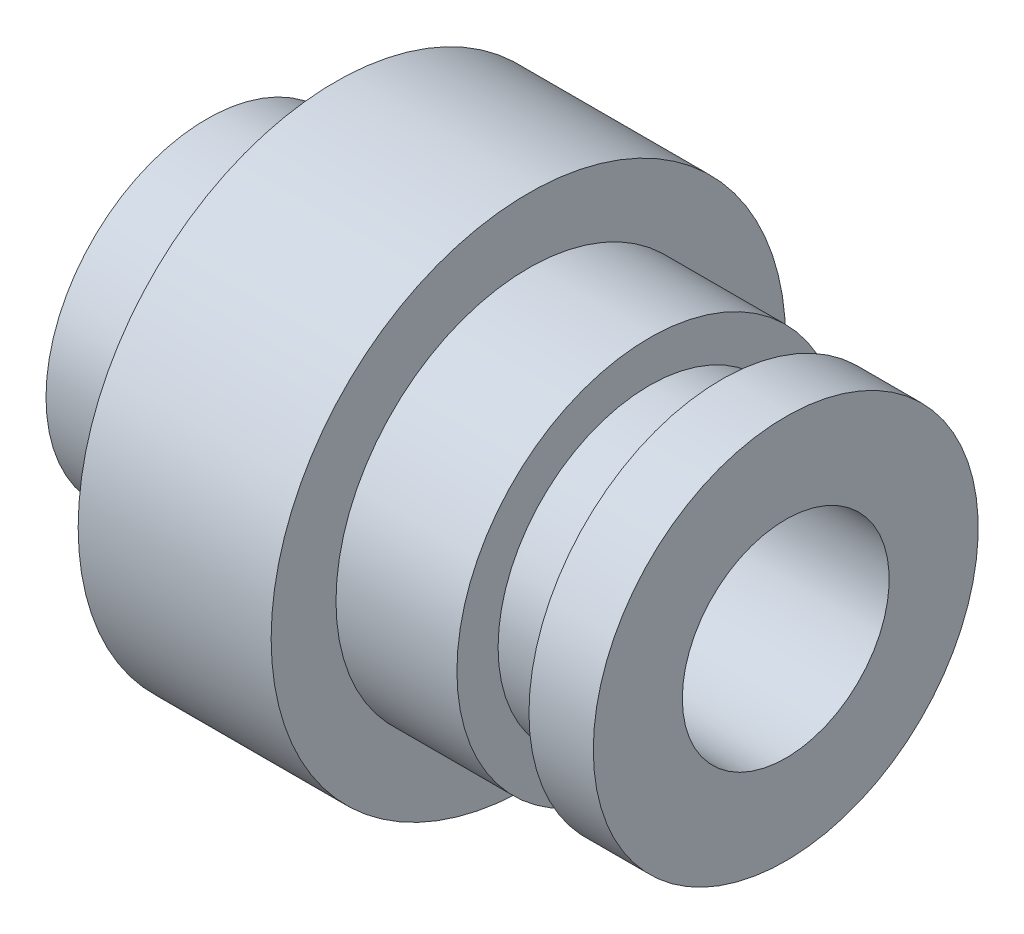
from build123d import *

# Parameters (mm, degrees)
FILLET1_R = 3.175


with BuildPart() as part:
    # Sketch1 → Revolve1 (revolve)
    with BuildSketch(Plane.XY, mode=Mode.PRIVATE) as revolve1_sk:
        Polygon((0, 6.35), (-12.7, 6.35), (-12.7, 7.9375), (-6.35, 7.9375), (-6.35, 12.7), (3.175, 12.7), (3.175, 9.4996), (9.144, 9.4996), (9.144, 7.4676), (12.7, 7.4676), (12.7, 9.4996), (15.875, 9.4996), (15.875, 5.1054), (0, 5.1054), align=None)
    revolve(revolve1_sk.sketch.rotate(Axis((0, 0, 0), (1, 0, 0)), 90), axis=Axis((0, 0, 0), (1, 0, 0)))

    # Fillet1
    fillet1_edges = [part.edges().sort_by_distance(p)[0] for p in [
        (-6.35, 0, -7.9375),
    ]]
    fillet(fillet1_edges, radius=FILLET1_R)


solid = part.part
